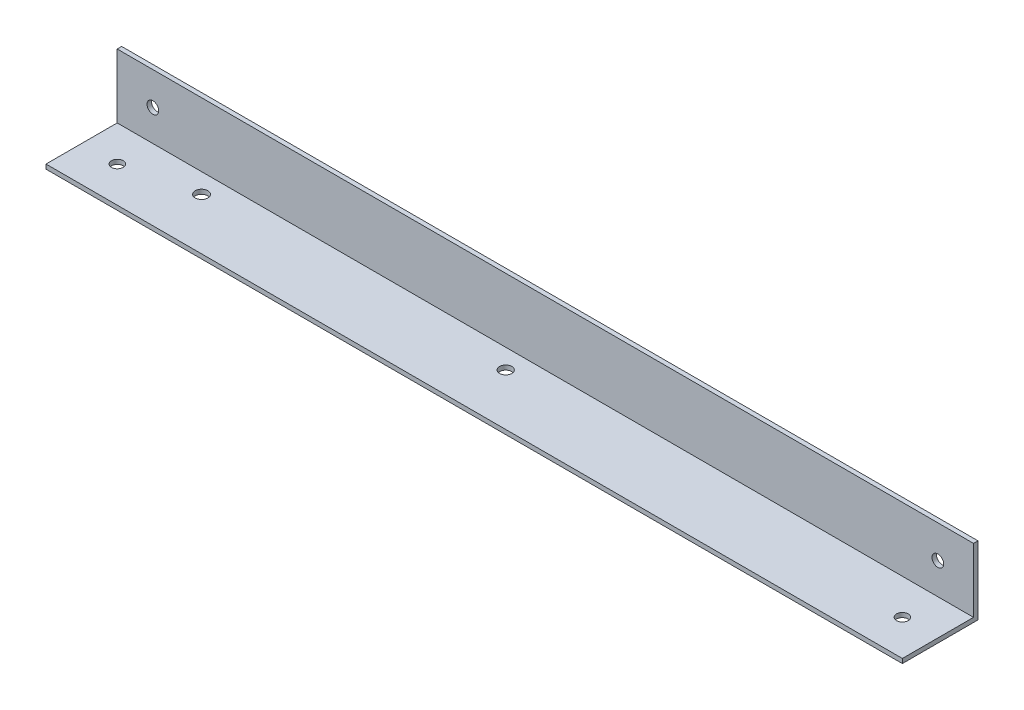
ISO-10303-21;
HEADER;
FILE_DESCRIPTION(('STEP AP214'),'2;1');
FILE_NAME('part.step','',(''),(''),'','','');
FILE_SCHEMA(('AUTOMOTIVE_DESIGN { 1 0 10303 214 1 1 1 1 }'));
ENDSEC;
DATA;
#1=APPLICATION_CONTEXT('core data for automotive mechanical design processes');
#2=APPLICATION_PROTOCOL_DEFINITION('international standard','automotive_design',2000,#1);
#3=PRODUCT_CONTEXT('',#1,'mechanical');
#4=PRODUCT('Part','Part','',(#3));
#5=PRODUCT_RELATED_PRODUCT_CATEGORY('part','',(#4));
#6=PRODUCT_DEFINITION_FORMATION('','',#4);
#7=PRODUCT_DEFINITION_CONTEXT('part definition',#1,'design');
#8=PRODUCT_DEFINITION('design','',#6,#7);
#9=PRODUCT_DEFINITION_SHAPE('','',#8);
#10=(LENGTH_UNIT() NAMED_UNIT(*) SI_UNIT(.MILLI.,.METRE.));
#11=(NAMED_UNIT(*) PLANE_ANGLE_UNIT() SI_UNIT($,.RADIAN.));
#12=(NAMED_UNIT(*) SI_UNIT($,.STERADIAN.) SOLID_ANGLE_UNIT());
#13=UNCERTAINTY_MEASURE_WITH_UNIT(LENGTH_MEASURE(1.E-05),#10,'distance_accuracy_value','');
#14=(GEOMETRIC_REPRESENTATION_CONTEXT(3) GLOBAL_UNCERTAINTY_ASSIGNED_CONTEXT((#13)) GLOBAL_UNIT_ASSIGNED_CONTEXT((#10,
#11,#12)) REPRESENTATION_CONTEXT('',''));
#15=CARTESIAN_POINT('',(0.,0.,0.));
#16=DIRECTION('',(0.,0.,1.));
#17=DIRECTION('',(1.,0.,0.));
#18=AXIS2_PLACEMENT_3D('',#15,#16,#17);
#19=CARTESIAN_POINT('',(0.,0.,26.924));
#20=DIRECTION('',(0.,0.,1.));
#21=DIRECTION('',(1.,0.,0.));
#22=AXIS2_PLACEMENT_3D('',#19,#20,#21);
#23=PLANE('',#22);
#24=DIRECTION('',(1.,0.,0.));
#25=VECTOR('',#24,1.);
#26=CARTESIAN_POINT('',(-209.826086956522,45.0420093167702,26.924));
#27=LINE('',#26,#25);
#28=CARTESIAN_POINT('',(-209.826086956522,45.0420093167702,26.924));
#29=VERTEX_POINT('',#28);
#30=CARTESIAN_POINT('',(94.9739130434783,45.0420093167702,26.924));
#31=VERTEX_POINT('',#30);
#32=EDGE_CURVE('E118',#29,#31,#27,.T.);
#33=ORIENTED_EDGE('',*,*,#32,.F.);
#34=DIRECTION('',(0.,-1.,0.));
#35=VECTOR('',#34,1.);
#36=CARTESIAN_POINT('',(-209.826086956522,67.8385093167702,26.924));
#37=LINE('',#36,#35);
#38=CARTESIAN_POINT('',(-209.826086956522,43.4545093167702,26.924));
#39=VERTEX_POINT('',#38);
#40=EDGE_CURVE('E96',#29,#39,#37,.T.);
#41=ORIENTED_EDGE('',*,*,#40,.T.);
#42=DIRECTION('',(1.,0.,0.));
#43=VECTOR('',#42,1.);
#44=CARTESIAN_POINT('',(-209.826086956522,43.4545093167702,26.924));
#45=LINE('',#44,#43);
#46=CARTESIAN_POINT('',(94.9739130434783,43.4545093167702,26.924));
#47=VERTEX_POINT('',#46);
#48=EDGE_CURVE('E58',#39,#47,#45,.T.);
#49=ORIENTED_EDGE('',*,*,#48,.T.);
#50=DIRECTION('',(0.,1.,0.));
#51=VECTOR('',#50,1.);
#52=CARTESIAN_POINT('',(94.9739130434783,67.8385093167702,26.924));
#53=LINE('',#52,#51);
#54=EDGE_CURVE('E89',#47,#31,#53,.T.);
#55=ORIENTED_EDGE('',*,*,#54,.T.);
#56=EDGE_LOOP('',(#33,#41,#49,#55));
#57=FACE_BOUND('',#56,.T.);
#58=ADVANCED_FACE('F39',(#57),#23,.T.);
#59=CARTESIAN_POINT('',(-209.826086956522,67.8385093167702,26.924));
#60=DIRECTION('',(1.,0.,0.));
#61=DIRECTION('',(0.,0.,-1.));
#62=AXIS2_PLACEMENT_3D('',#59,#60,#61);
#63=PLANE('',#62);
#64=DIRECTION('',(0.,0.,1.));
#65=VECTOR('',#64,1.);
#66=CARTESIAN_POINT('',(-209.826086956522,45.0420093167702,-303.37967743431));
#67=LINE('',#66,#65);
#68=CARTESIAN_POINT('',(-209.826086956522,45.0420093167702,1.58750000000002));
#69=VERTEX_POINT('',#68);
#70=EDGE_CURVE('E149',#69,#29,#67,.T.);
#71=ORIENTED_EDGE('',*,*,#70,.F.);
#72=DIRECTION('',(0.,1.,0.));
#73=VECTOR('',#72,1.);
#74=CARTESIAN_POINT('',(-209.826086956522,55.1385093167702,1.5875));
#75=LINE('',#74,#73);
#76=CARTESIAN_POINT('',(-209.826086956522,67.8385093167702,1.5875));
#77=VERTEX_POINT('',#76);
#78=EDGE_CURVE('E88',#69,#77,#75,.T.);
#79=ORIENTED_EDGE('',*,*,#78,.T.);
#80=DIRECTION('',(0.,0.,-1.));
#81=VECTOR('',#80,1.);
#82=CARTESIAN_POINT('',(-209.826086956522,67.8385093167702,26.924));
#83=LINE('',#82,#81);
#84=CARTESIAN_POINT('',(-209.826086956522,67.8385093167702,0.));
#85=VERTEX_POINT('',#84);
#86=EDGE_CURVE('E82',#77,#85,#83,.T.);
#87=ORIENTED_EDGE('',*,*,#86,.T.);
#88=DIRECTION('',(0.,-1.,0.));
#89=VECTOR('',#88,1.);
#90=CARTESIAN_POINT('',(-209.826086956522,67.8385093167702,0.));
#91=LINE('',#90,#89);
#92=CARTESIAN_POINT('',(-209.826086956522,43.4545093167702,0.));
#93=VERTEX_POINT('',#92);
#94=EDGE_CURVE('E86',#85,#93,#91,.T.);
#95=ORIENTED_EDGE('',*,*,#94,.T.);
#96=DIRECTION('',(0.,0.,-1.));
#97=VECTOR('',#96,1.);
#98=CARTESIAN_POINT('',(-209.826086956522,43.4545093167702,26.924));
#99=LINE('',#98,#97);
#100=EDGE_CURVE('E11',#39,#93,#99,.T.);
#101=ORIENTED_EDGE('',*,*,#100,.F.);
#102=ORIENTED_EDGE('',*,*,#40,.F.);
#103=EDGE_LOOP('',(#71,#79,#87,#95,#101,#102));
#104=FACE_BOUND('',#103,.T.);
#105=ADVANCED_FACE('F41',(#104),#63,.F.);
#106=CARTESIAN_POINT('',(-209.826086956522,43.4545093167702,26.924));
#107=DIRECTION('',(0.,1.,0.));
#108=DIRECTION('',(0.,0.,1.));
#109=AXIS2_PLACEMENT_3D('',#106,#107,#108);
#110=PLANE('',#109);
#111=CARTESIAN_POINT('',(-64.5339504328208,43.4545093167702,8.58749999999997));
#112=DIRECTION('',(0.,1.,0.));
#113=DIRECTION('',(0.,0.,1.));
#114=AXIS2_PLACEMENT_3D('',#111,#112,#113);
#115=CIRCLE('',#114,2.16614991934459);
#116=CARTESIAN_POINT('',(-64.5339504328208,43.4545093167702,10.7536499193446));
#117=VERTEX_POINT('',#116);
#118=EDGE_CURVE('E132',#117,#117,#115,.T.);
#119=ORIENTED_EDGE('',*,*,#118,.T.);
#120=EDGE_LOOP('',(#119));
#121=FACE_BOUND('',#120,.T.);
#122=CARTESIAN_POINT('',(-172.80147521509,43.4545093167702,8.58749999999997));
#123=DIRECTION('',(0.,1.,0.));
#124=DIRECTION('',(0.,0.,1.));
#125=AXIS2_PLACEMENT_3D('',#122,#123,#124);
#126=CIRCLE('',#125,2.25000000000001);
#127=CARTESIAN_POINT('',(-172.80147521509,43.4545093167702,10.8375));
#128=VERTEX_POINT('',#127);
#129=EDGE_CURVE('E344',#128,#128,#126,.T.);
#130=ORIENTED_EDGE('',*,*,#129,.T.);
#131=EDGE_LOOP('',(#130));
#132=FACE_BOUND('',#131,.T.);
#133=CARTESIAN_POINT('',(-197.126086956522,43.4545093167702,14.224));
#134=DIRECTION('',(0.,-1.,0.));
#135=DIRECTION('',(0.,0.,-1.));
#136=AXIS2_PLACEMENT_3D('',#133,#134,#135);
#137=CIRCLE('',#136,2.08279999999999);
#138=CARTESIAN_POINT('',(-197.126086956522,43.4545093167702,12.1412));
#139=VERTEX_POINT('',#138);
#140=EDGE_CURVE('E121',#139,#139,#137,.T.);
#141=ORIENTED_EDGE('',*,*,#140,.F.);
#142=EDGE_LOOP('',(#141));
#143=FACE_BOUND('',#142,.T.);
#144=CARTESIAN_POINT('',(82.2739130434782,43.4545093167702,14.224));
#145=DIRECTION('',(0.,-1.,0.));
#146=DIRECTION('',(0.,0.,1.));
#147=AXIS2_PLACEMENT_3D('',#144,#145,#146);
#148=CIRCLE('',#147,2.0828);
#149=CARTESIAN_POINT('',(82.2739130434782,43.4545093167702,16.3068));
#150=VERTEX_POINT('',#149);
#151=EDGE_CURVE('E127',#150,#150,#148,.T.);
#152=ORIENTED_EDGE('',*,*,#151,.F.);
#153=EDGE_LOOP('',(#152));
#154=FACE_BOUND('',#153,.T.);
#155=DIRECTION('',(1.,0.,0.));
#156=VECTOR('',#155,1.);
#157=CARTESIAN_POINT('',(-209.826086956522,43.4545093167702,0.));
#158=LINE('',#157,#156);
#159=CARTESIAN_POINT('',(94.9739130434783,43.4545093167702,0.));
#160=VERTEX_POINT('',#159);
#161=EDGE_CURVE('E100',#93,#160,#158,.T.);
#162=ORIENTED_EDGE('',*,*,#161,.T.);
#163=DIRECTION('',(0.,0.,-1.));
#164=VECTOR('',#163,1.);
#165=CARTESIAN_POINT('',(94.9739130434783,43.4545093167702,26.924));
#166=LINE('',#165,#164);
#167=EDGE_CURVE('E49',#47,#160,#166,.T.);
#168=ORIENTED_EDGE('',*,*,#167,.F.);
#169=ORIENTED_EDGE('',*,*,#48,.F.);
#170=ORIENTED_EDGE('',*,*,#100,.T.);
#171=EDGE_LOOP('',(#162,#168,#169,#170));
#172=FACE_BOUND('',#171,.T.);
#173=ADVANCED_FACE('F180',(#121,#132,#143,#154,#172),#110,.F.);
#174=CARTESIAN_POINT('',(94.9739130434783,67.8385093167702,26.924));
#175=DIRECTION('',(-1.,0.,0.));
#176=DIRECTION('',(0.,0.,1.));
#177=AXIS2_PLACEMENT_3D('',#174,#175,#176);
#178=PLANE('',#177);
#179=DIRECTION('',(0.,1.,0.));
#180=VECTOR('',#179,1.);
#181=CARTESIAN_POINT('',(94.9739130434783,55.1385093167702,1.5875));
#182=LINE('',#181,#180);
#183=CARTESIAN_POINT('',(94.9739130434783,45.0420093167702,1.58750000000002));
#184=VERTEX_POINT('',#183);
#185=CARTESIAN_POINT('',(94.9739130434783,67.8385093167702,1.5875));
#186=VERTEX_POINT('',#185);
#187=EDGE_CURVE('E103',#184,#186,#182,.T.);
#188=ORIENTED_EDGE('',*,*,#187,.F.);
#189=DIRECTION('',(0.,0.,1.));
#190=VECTOR('',#189,1.);
#191=CARTESIAN_POINT('',(94.9739130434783,45.0420093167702,-303.37967743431));
#192=LINE('',#191,#190);
#193=EDGE_CURVE('E146',#184,#31,#192,.T.);
#194=ORIENTED_EDGE('',*,*,#193,.T.);
#195=ORIENTED_EDGE('',*,*,#54,.F.);
#196=ORIENTED_EDGE('',*,*,#167,.T.);
#197=DIRECTION('',(0.,1.,0.));
#198=VECTOR('',#197,1.);
#199=CARTESIAN_POINT('',(94.9739130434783,67.8385093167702,0.));
#200=LINE('',#199,#198);
#201=CARTESIAN_POINT('',(94.9739130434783,67.8385093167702,0.));
#202=VERTEX_POINT('',#201);
#203=EDGE_CURVE('E97',#160,#202,#200,.T.);
#204=ORIENTED_EDGE('',*,*,#203,.T.);
#205=DIRECTION('',(0.,0.,-1.));
#206=VECTOR('',#205,1.);
#207=CARTESIAN_POINT('',(94.9739130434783,67.8385093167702,26.924));
#208=LINE('',#207,#206);
#209=EDGE_CURVE('E75',#186,#202,#208,.T.);
#210=ORIENTED_EDGE('',*,*,#209,.F.);
#211=EDGE_LOOP('',(#188,#194,#195,#196,#204,#210));
#212=FACE_BOUND('',#211,.T.);
#213=ADVANCED_FACE('F166',(#212),#178,.F.);
#214=CARTESIAN_POINT('',(-209.826086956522,67.8385093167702,26.924));
#215=DIRECTION('',(0.,-1.,0.));
#216=DIRECTION('',(0.,0.,-1.));
#217=AXIS2_PLACEMENT_3D('',#214,#215,#216);
#218=PLANE('',#217);
#219=ORIENTED_EDGE('',*,*,#86,.F.);
#220=DIRECTION('',(-1.,0.,0.));
#221=VECTOR('',#220,1.);
#222=CARTESIAN_POINT('',(-209.826086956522,67.8385093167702,1.5875));
#223=LINE('',#222,#221);
#224=EDGE_CURVE('E152',#186,#77,#223,.T.);
#225=ORIENTED_EDGE('',*,*,#224,.F.);
#226=ORIENTED_EDGE('',*,*,#209,.T.);
#227=DIRECTION('',(-1.,0.,0.));
#228=VECTOR('',#227,1.);
#229=CARTESIAN_POINT('',(-209.826086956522,67.8385093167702,0.));
#230=LINE('',#229,#228);
#231=EDGE_CURVE('E92',#202,#85,#230,.T.);
#232=ORIENTED_EDGE('',*,*,#231,.T.);
#233=EDGE_LOOP('',(#219,#225,#226,#232));
#234=FACE_BOUND('',#233,.T.);
#235=ADVANCED_FACE('F93',(#234),#218,.F.);
#236=CARTESIAN_POINT('',(0.,0.,0.));
#237=DIRECTION('',(0.,0.,1.));
#238=DIRECTION('',(1.,0.,0.));
#239=AXIS2_PLACEMENT_3D('',#236,#237,#238);
#240=PLANE('',#239);
#241=CARTESIAN_POINT('',(82.2739130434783,56.1545093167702,0.));
#242=DIRECTION('',(0.,0.,-1.));
#243=DIRECTION('',(-1.,0.,0.));
#244=AXIS2_PLACEMENT_3D('',#241,#242,#243);
#245=CIRCLE('',#244,2.0828);
#246=CARTESIAN_POINT('',(80.1911130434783,56.1545093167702,0.));
#247=VERTEX_POINT('',#246);
#248=EDGE_CURVE('E116',#247,#247,#245,.T.);
#249=ORIENTED_EDGE('',*,*,#248,.F.);
#250=EDGE_LOOP('',(#249));
#251=FACE_BOUND('',#250,.T.);
#252=CARTESIAN_POINT('',(-197.126086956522,56.1545093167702,0.));
#253=DIRECTION('',(0.,0.,-1.));
#254=DIRECTION('',(1.,0.,0.));
#255=AXIS2_PLACEMENT_3D('',#252,#253,#254);
#256=CIRCLE('',#255,2.08279999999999);
#257=CARTESIAN_POINT('',(-195.043286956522,56.1545093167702,0.));
#258=VERTEX_POINT('',#257);
#259=EDGE_CURVE('E125',#258,#258,#256,.T.);
#260=ORIENTED_EDGE('',*,*,#259,.F.);
#261=EDGE_LOOP('',(#260));
#262=FACE_BOUND('',#261,.T.);
#263=ORIENTED_EDGE('',*,*,#94,.F.);
#264=ORIENTED_EDGE('',*,*,#231,.F.);
#265=ORIENTED_EDGE('',*,*,#203,.F.);
#266=ORIENTED_EDGE('',*,*,#161,.F.);
#267=EDGE_LOOP('',(#263,#264,#265,#266));
#268=FACE_BOUND('',#267,.T.);
#269=ADVANCED_FACE('F99',(#251,#262,#268),#240,.F.);
#270=CARTESIAN_POINT('',(-209.826086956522,55.1385093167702,1.5875));
#271=DIRECTION('',(0.,0.,-1.));
#272=DIRECTION('',(-1.,0.,0.));
#273=AXIS2_PLACEMENT_3D('',#270,#271,#272);
#274=PLANE('',#273);
#275=CARTESIAN_POINT('',(82.2739130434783,56.1545093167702,1.5875));
#276=DIRECTION('',(0.,0.,-1.));
#277=DIRECTION('',(-1.,0.,0.));
#278=AXIS2_PLACEMENT_3D('',#275,#276,#277);
#279=CIRCLE('',#278,2.0828);
#280=CARTESIAN_POINT('',(80.1911130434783,56.1545093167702,1.5875));
#281=VERTEX_POINT('',#280);
#282=EDGE_CURVE('E115',#281,#281,#279,.T.);
#283=ORIENTED_EDGE('',*,*,#282,.T.);
#284=EDGE_LOOP('',(#283));
#285=FACE_BOUND('',#284,.T.);
#286=CARTESIAN_POINT('',(-197.126086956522,56.1545093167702,1.5875));
#287=DIRECTION('',(0.,0.,-1.));
#288=DIRECTION('',(-1.,0.,0.));
#289=AXIS2_PLACEMENT_3D('',#286,#287,#288);
#290=CIRCLE('',#289,2.08279999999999);
#291=CARTESIAN_POINT('',(-199.208886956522,56.1545093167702,1.5875));
#292=VERTEX_POINT('',#291);
#293=EDGE_CURVE('E112',#292,#292,#290,.T.);
#294=ORIENTED_EDGE('',*,*,#293,.T.);
#295=EDGE_LOOP('',(#294));
#296=FACE_BOUND('',#295,.T.);
#297=ORIENTED_EDGE('',*,*,#224,.T.);
#298=ORIENTED_EDGE('',*,*,#78,.F.);
#299=DIRECTION('',(1.,0.,0.));
#300=VECTOR('',#299,1.);
#301=CARTESIAN_POINT('',(-209.826086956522,45.0420093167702,1.58750000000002));
#302=LINE('',#301,#300);
#303=EDGE_CURVE('E143',#69,#184,#302,.T.);
#304=ORIENTED_EDGE('',*,*,#303,.T.);
#305=ORIENTED_EDGE('',*,*,#187,.T.);
#306=EDGE_LOOP('',(#297,#298,#304,#305));
#307=FACE_BOUND('',#306,.T.);
#308=ADVANCED_FACE('F174',(#285,#296,#307),#274,.F.);
#309=CARTESIAN_POINT('',(-209.826086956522,45.0420093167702,-303.37967743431));
#310=DIRECTION('',(0.,-1.,0.));
#311=DIRECTION('',(0.,0.,-1.));
#312=AXIS2_PLACEMENT_3D('',#309,#310,#311);
#313=PLANE('',#312);
#314=CARTESIAN_POINT('',(-64.5339504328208,45.0420093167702,8.58749999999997));
#315=DIRECTION('',(0.,1.,0.));
#316=DIRECTION('',(0.,0.,1.));
#317=AXIS2_PLACEMENT_3D('',#314,#315,#316);
#318=CIRCLE('',#317,2.16614991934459);
#319=CARTESIAN_POINT('',(-64.5339504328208,45.0420093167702,10.7536499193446));
#320=VERTEX_POINT('',#319);
#321=EDGE_CURVE('E342',#320,#320,#318,.T.);
#322=ORIENTED_EDGE('',*,*,#321,.F.);
#323=EDGE_LOOP('',(#322));
#324=FACE_BOUND('',#323,.T.);
#325=CARTESIAN_POINT('',(-172.80147521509,45.0420093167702,8.58749999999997));
#326=DIRECTION('',(0.,1.,0.));
#327=DIRECTION('',(0.,0.,1.));
#328=AXIS2_PLACEMENT_3D('',#325,#326,#327);
#329=CIRCLE('',#328,2.25000000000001);
#330=CARTESIAN_POINT('',(-172.80147521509,45.0420093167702,10.8375));
#331=VERTEX_POINT('',#330);
#332=EDGE_CURVE('E347',#331,#331,#329,.T.);
#333=ORIENTED_EDGE('',*,*,#332,.F.);
#334=EDGE_LOOP('',(#333));
#335=FACE_BOUND('',#334,.T.);
#336=CARTESIAN_POINT('',(-197.126086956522,45.0420093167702,14.224));
#337=DIRECTION('',(0.,-1.,0.));
#338=DIRECTION('',(0.,0.,-1.));
#339=AXIS2_PLACEMENT_3D('',#336,#337,#338);
#340=CIRCLE('',#339,2.08279999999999);
#341=CARTESIAN_POINT('',(-197.126086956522,45.0420093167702,12.1412));
#342=VERTEX_POINT('',#341);
#343=EDGE_CURVE('E43',#342,#342,#340,.T.);
#344=ORIENTED_EDGE('',*,*,#343,.T.);
#345=EDGE_LOOP('',(#344));
#346=FACE_BOUND('',#345,.T.);
#347=CARTESIAN_POINT('',(82.2739130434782,45.0420093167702,14.224));
#348=DIRECTION('',(0.,-1.,0.));
#349=DIRECTION('',(0.,0.,-1.));
#350=AXIS2_PLACEMENT_3D('',#347,#348,#349);
#351=CIRCLE('',#350,2.0828);
#352=CARTESIAN_POINT('',(82.2739130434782,45.0420093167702,12.1412));
#353=VERTEX_POINT('',#352);
#354=EDGE_CURVE('E119',#353,#353,#351,.T.);
#355=ORIENTED_EDGE('',*,*,#354,.T.);
#356=EDGE_LOOP('',(#355));
#357=FACE_BOUND('',#356,.T.);
#358=ORIENTED_EDGE('',*,*,#70,.T.);
#359=ORIENTED_EDGE('',*,*,#32,.T.);
#360=ORIENTED_EDGE('',*,*,#193,.F.);
#361=ORIENTED_EDGE('',*,*,#303,.F.);
#362=EDGE_LOOP('',(#358,#359,#360,#361));
#363=FACE_BOUND('',#362,.T.);
#364=ADVANCED_FACE('F171',(#324,#335,#346,#357,#363),#313,.F.);
#365=CARTESIAN_POINT('',(-197.126086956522,56.1545093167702,2.54));
#366=DIRECTION('',(0.,0.,-1.));
#367=DIRECTION('',(-1.,0.,0.));
#368=AXIS2_PLACEMENT_3D('',#365,#366,#367);
#369=CYLINDRICAL_SURFACE('',#368,2.08279999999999);
#370=ORIENTED_EDGE('',*,*,#259,.T.);
#371=EDGE_LOOP('',(#370));
#372=FACE_BOUND('',#371,.T.);
#373=ORIENTED_EDGE('',*,*,#293,.F.);
#374=EDGE_LOOP('',(#373));
#375=FACE_BOUND('',#374,.T.);
#376=ADVANCED_FACE('F222',(#372,#375),#369,.F.);
#377=CARTESIAN_POINT('',(82.2739130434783,56.1545093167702,2.54));
#378=DIRECTION('',(0.,0.,-1.));
#379=DIRECTION('',(-1.,0.,0.));
#380=AXIS2_PLACEMENT_3D('',#377,#378,#379);
#381=CYLINDRICAL_SURFACE('',#380,2.0828);
#382=ORIENTED_EDGE('',*,*,#248,.T.);
#383=EDGE_LOOP('',(#382));
#384=FACE_BOUND('',#383,.T.);
#385=ORIENTED_EDGE('',*,*,#282,.F.);
#386=EDGE_LOOP('',(#385));
#387=FACE_BOUND('',#386,.T.);
#388=ADVANCED_FACE('F229',(#384,#387),#381,.F.);
#389=CARTESIAN_POINT('',(82.2739130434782,45.9945093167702,14.224));
#390=DIRECTION('',(0.,-1.,0.));
#391=DIRECTION('',(0.,0.,-1.));
#392=AXIS2_PLACEMENT_3D('',#389,#390,#391);
#393=CYLINDRICAL_SURFACE('',#392,2.0828);
#394=ORIENTED_EDGE('',*,*,#151,.T.);
#395=EDGE_LOOP('',(#394));
#396=FACE_BOUND('',#395,.T.);
#397=ORIENTED_EDGE('',*,*,#354,.F.);
#398=EDGE_LOOP('',(#397));
#399=FACE_BOUND('',#398,.T.);
#400=ADVANCED_FACE('F237',(#396,#399),#393,.F.);
#401=CARTESIAN_POINT('',(-197.126086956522,45.9945093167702,14.224));
#402=DIRECTION('',(0.,-1.,0.));
#403=DIRECTION('',(0.,0.,-1.));
#404=AXIS2_PLACEMENT_3D('',#401,#402,#403);
#405=CYLINDRICAL_SURFACE('',#404,2.08279999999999);
#406=ORIENTED_EDGE('',*,*,#140,.T.);
#407=EDGE_LOOP('',(#406));
#408=FACE_BOUND('',#407,.T.);
#409=ORIENTED_EDGE('',*,*,#343,.F.);
#410=EDGE_LOOP('',(#409));
#411=FACE_BOUND('',#410,.T.);
#412=ADVANCED_FACE('F245',(#408,#411),#405,.F.);
#413=CARTESIAN_POINT('',(-172.80147521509,42.5020093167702,8.58749999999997));
#414=DIRECTION('',(0.,1.,0.));
#415=DIRECTION('',(0.,0.,1.));
#416=AXIS2_PLACEMENT_3D('',#413,#414,#415);
#417=CYLINDRICAL_SURFACE('',#416,2.25000000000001);
#418=ORIENTED_EDGE('',*,*,#332,.T.);
#419=EDGE_LOOP('',(#418));
#420=FACE_BOUND('',#419,.T.);
#421=ORIENTED_EDGE('',*,*,#129,.F.);
#422=EDGE_LOOP('',(#421));
#423=FACE_BOUND('',#422,.T.);
#424=ADVANCED_FACE('F253',(#420,#423),#417,.F.);
#425=CARTESIAN_POINT('',(-64.5339504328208,42.5020093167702,8.58749999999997));
#426=DIRECTION('',(0.,1.,0.));
#427=DIRECTION('',(0.,0.,1.));
#428=AXIS2_PLACEMENT_3D('',#425,#426,#427);
#429=CYLINDRICAL_SURFACE('',#428,2.16614991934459);
#430=ORIENTED_EDGE('',*,*,#321,.T.);
#431=EDGE_LOOP('',(#430));
#432=FACE_BOUND('',#431,.T.);
#433=ORIENTED_EDGE('',*,*,#118,.F.);
#434=EDGE_LOOP('',(#433));
#435=FACE_BOUND('',#434,.T.);
#436=ADVANCED_FACE('F259',(#432,#435),#429,.F.);
#437=CLOSED_SHELL('',(#58,#105,#173,#213,#235,#269,#308,#364,#376,#388,#400,#412,#424,#436));
#438=MANIFOLD_SOLID_BREP('B2',#437);
#439=ADVANCED_BREP_SHAPE_REPRESENTATION('',(#18,#438),#14);
#440=SHAPE_DEFINITION_REPRESENTATION(#9,#439);
ENDSEC;
END-ISO-10303-21;
